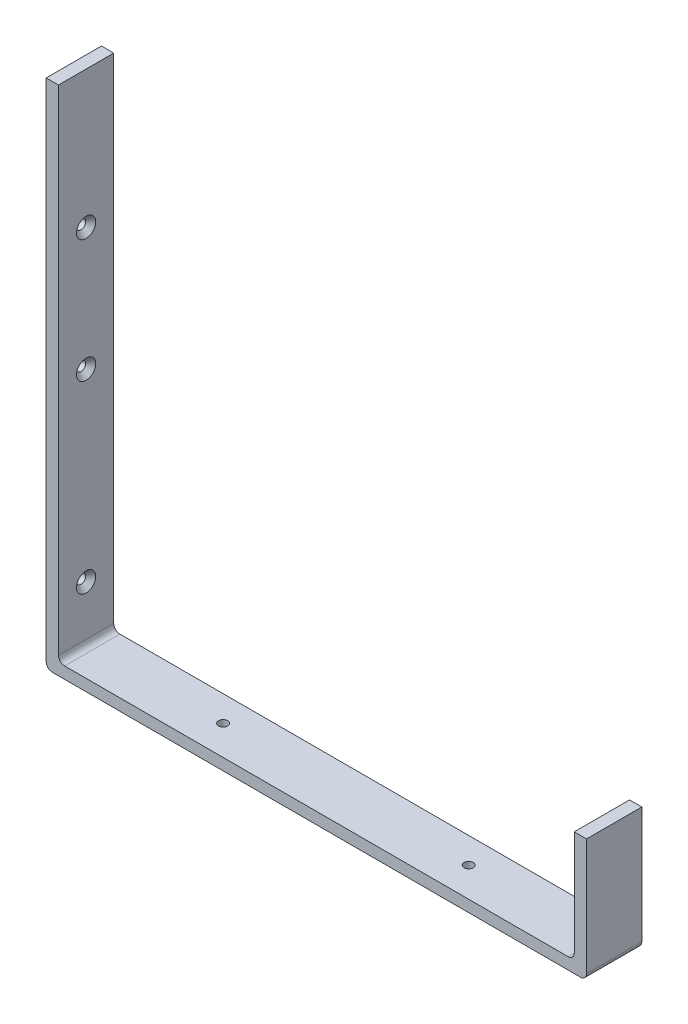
ISO-10303-21;
HEADER;
FILE_DESCRIPTION(('STEP AP214'),'2;1');
FILE_NAME('part.step','',(''),(''),'','','');
FILE_SCHEMA(('AUTOMOTIVE_DESIGN { 1 0 10303 214 1 1 1 1 }'));
ENDSEC;
DATA;
#1=APPLICATION_CONTEXT('core data for automotive mechanical design processes');
#2=APPLICATION_PROTOCOL_DEFINITION('international standard','automotive_design',2000,#1);
#3=PRODUCT_CONTEXT('',#1,'mechanical');
#4=PRODUCT('Part','Part','',(#3));
#5=PRODUCT_RELATED_PRODUCT_CATEGORY('part','',(#4));
#6=PRODUCT_DEFINITION_FORMATION('','',#4);
#7=PRODUCT_DEFINITION_CONTEXT('part definition',#1,'design');
#8=PRODUCT_DEFINITION('design','',#6,#7);
#9=PRODUCT_DEFINITION_SHAPE('','',#8);
#10=(LENGTH_UNIT() NAMED_UNIT(*) SI_UNIT(.MILLI.,.METRE.));
#11=(NAMED_UNIT(*) PLANE_ANGLE_UNIT() SI_UNIT($,.RADIAN.));
#12=(NAMED_UNIT(*) SI_UNIT($,.STERADIAN.) SOLID_ANGLE_UNIT());
#13=UNCERTAINTY_MEASURE_WITH_UNIT(LENGTH_MEASURE(1.E-05),#10,'distance_accuracy_value','');
#14=(GEOMETRIC_REPRESENTATION_CONTEXT(3) GLOBAL_UNCERTAINTY_ASSIGNED_CONTEXT((#13)) GLOBAL_UNIT_ASSIGNED_CONTEXT((#10,
#11,#12)) REPRESENTATION_CONTEXT('',''));
#15=CARTESIAN_POINT('',(0.,0.,0.));
#16=DIRECTION('',(0.,0.,1.));
#17=DIRECTION('',(1.,0.,0.));
#18=AXIS2_PLACEMENT_3D('',#15,#16,#17);
#19=CARTESIAN_POINT('',(-132.,125.,27.));
#20=DIRECTION('',(0.,-1.,0.));
#21=DIRECTION('',(0.,0.,-1.));
#22=AXIS2_PLACEMENT_3D('',#19,#20,#21);
#23=PLANE('',#22);
#24=DIRECTION('',(-1.,0.,0.));
#25=VECTOR('',#24,1.);
#26=CARTESIAN_POINT('',(-132.,125.,0.));
#27=LINE('',#26,#25);
#28=CARTESIAN_POINT('',(-126.,125.,0.));
#29=VERTEX_POINT('',#28);
#30=CARTESIAN_POINT('',(-132.,125.,0.));
#31=VERTEX_POINT('',#30);
#32=EDGE_CURVE('E147',#29,#31,#27,.T.);
#33=ORIENTED_EDGE('',*,*,#32,.T.);
#34=DIRECTION('',(0.,0.,-1.));
#35=VECTOR('',#34,1.);
#36=CARTESIAN_POINT('',(-132.,125.,27.));
#37=LINE('',#36,#35);
#38=CARTESIAN_POINT('',(-132.,125.,27.));
#39=VERTEX_POINT('',#38);
#40=EDGE_CURVE('E130',#39,#31,#37,.T.);
#41=ORIENTED_EDGE('',*,*,#40,.F.);
#42=DIRECTION('',(-1.,0.,0.));
#43=VECTOR('',#42,1.);
#44=CARTESIAN_POINT('',(-132.,125.,27.));
#45=LINE('',#44,#43);
#46=CARTESIAN_POINT('',(-126.,125.,27.));
#47=VERTEX_POINT('',#46);
#48=EDGE_CURVE('E136',#47,#39,#45,.T.);
#49=ORIENTED_EDGE('',*,*,#48,.F.);
#50=DIRECTION('',(0.,0.,-1.));
#51=VECTOR('',#50,1.);
#52=CARTESIAN_POINT('',(-126.,125.,27.));
#53=LINE('',#52,#51);
#54=EDGE_CURVE('E212',#47,#29,#53,.T.);
#55=ORIENTED_EDGE('',*,*,#54,.T.);
#56=EDGE_LOOP('',(#33,#41,#49,#55));
#57=FACE_BOUND('',#56,.T.);
#58=ADVANCED_FACE('F35',(#57),#23,.F.);
#59=CARTESIAN_POINT('',(-132.,-125.,27.));
#60=DIRECTION('',(1.,0.,0.));
#61=DIRECTION('',(0.,0.,-1.));
#62=AXIS2_PLACEMENT_3D('',#59,#60,#61);
#63=PLANE('',#62);
#64=CARTESIAN_POINT('',(-132.,-92.,13.5));
#65=DIRECTION('',(1.,0.,0.));
#66=DIRECTION('',(0.,0.,-1.));
#67=AXIS2_PLACEMENT_3D('',#64,#65,#66);
#68=CIRCLE('',#67,2.25);
#69=CARTESIAN_POINT('',(-132.,-92.,11.25));
#70=VERTEX_POINT('',#69);
#71=EDGE_CURVE('E351',#70,#70,#68,.T.);
#72=ORIENTED_EDGE('',*,*,#71,.T.);
#73=EDGE_LOOP('',(#72));
#74=FACE_BOUND('',#73,.T.);
#75=CARTESIAN_POINT('',(-132.,58.,13.5));
#76=DIRECTION('',(1.,0.,0.));
#77=DIRECTION('',(0.,0.,-1.));
#78=AXIS2_PLACEMENT_3D('',#75,#76,#77);
#79=CIRCLE('',#78,2.25);
#80=CARTESIAN_POINT('',(-132.,58.,11.25));
#81=VERTEX_POINT('',#80);
#82=EDGE_CURVE('E342',#81,#81,#79,.T.);
#83=ORIENTED_EDGE('',*,*,#82,.T.);
#84=EDGE_LOOP('',(#83));
#85=FACE_BOUND('',#84,.T.);
#86=CARTESIAN_POINT('',(-132.,-2.00000000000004,13.5));
#87=DIRECTION('',(1.,0.,0.));
#88=DIRECTION('',(0.,0.,-1.));
#89=AXIS2_PLACEMENT_3D('',#86,#87,#88);
#90=CIRCLE('',#89,2.25);
#91=CARTESIAN_POINT('',(-132.,-2.00000000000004,11.25));
#92=VERTEX_POINT('',#91);
#93=EDGE_CURVE('E331',#92,#92,#90,.T.);
#94=ORIENTED_EDGE('',*,*,#93,.T.);
#95=EDGE_LOOP('',(#94));
#96=FACE_BOUND('',#95,.T.);
#97=DIRECTION('',(0.,-1.,0.));
#98=VECTOR('',#97,1.);
#99=CARTESIAN_POINT('',(-132.,-125.,0.));
#100=LINE('',#99,#98);
#101=CARTESIAN_POINT('',(-132.,-122.,0.));
#102=VERTEX_POINT('',#101);
#103=EDGE_CURVE('E190',#31,#102,#100,.T.);
#104=ORIENTED_EDGE('',*,*,#103,.T.);
#105=DIRECTION('',(0.,0.,-1.));
#106=VECTOR('',#105,1.);
#107=CARTESIAN_POINT('',(-132.,-122.,27.));
#108=LINE('',#107,#106);
#109=CARTESIAN_POINT('',(-132.,-122.,27.));
#110=VERTEX_POINT('',#109);
#111=EDGE_CURVE('E133',#102,#110,#108,.F.);
#112=ORIENTED_EDGE('',*,*,#111,.T.);
#113=DIRECTION('',(0.,-1.,0.));
#114=VECTOR('',#113,1.);
#115=CARTESIAN_POINT('',(-132.,-125.,27.));
#116=LINE('',#115,#114);
#117=EDGE_CURVE('E125',#39,#110,#116,.T.);
#118=ORIENTED_EDGE('',*,*,#117,.F.);
#119=ORIENTED_EDGE('',*,*,#40,.T.);
#120=EDGE_LOOP('',(#104,#112,#118,#119));
#121=FACE_BOUND('',#120,.T.);
#122=ADVANCED_FACE('F128',(#74,#85,#96,#121),#63,.F.);
#123=CARTESIAN_POINT('',(132.,-125.,27.));
#124=DIRECTION('',(0.,1.,0.));
#125=DIRECTION('',(-1.,0.,0.));
#126=AXIS2_PLACEMENT_3D('',#123,#124,#125);
#127=PLANE('',#126);
#128=CARTESIAN_POINT('',(-60.,-125.,12.5721452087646));
#129=DIRECTION('',(0.,-1.,0.));
#130=DIRECTION('',(0.,0.,-1.));
#131=AXIS2_PLACEMENT_3D('',#128,#129,#130);
#132=CIRCLE('',#131,4.7);
#133=CARTESIAN_POINT('',(-60.,-125.,7.8721452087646));
#134=VERTEX_POINT('',#133);
#135=EDGE_CURVE('E327',#134,#134,#132,.T.);
#136=ORIENTED_EDGE('',*,*,#135,.F.);
#137=EDGE_LOOP('',(#136));
#138=FACE_BOUND('',#137,.T.);
#139=CARTESIAN_POINT('',(60.,-125.,12.5721452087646));
#140=DIRECTION('',(0.,-1.,0.));
#141=DIRECTION('',(0.,0.,-1.));
#142=AXIS2_PLACEMENT_3D('',#139,#140,#141);
#143=CIRCLE('',#142,4.7);
#144=CARTESIAN_POINT('',(60.,-125.,7.8721452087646));
#145=VERTEX_POINT('',#144);
#146=EDGE_CURVE('E193',#145,#145,#143,.T.);
#147=ORIENTED_EDGE('',*,*,#146,.F.);
#148=EDGE_LOOP('',(#147));
#149=FACE_BOUND('',#148,.T.);
#150=DIRECTION('',(1.,0.,0.));
#151=VECTOR('',#150,1.);
#152=CARTESIAN_POINT('',(132.,-125.,27.));
#153=LINE('',#152,#151);
#154=CARTESIAN_POINT('',(-129.,-125.,27.));
#155=VERTEX_POINT('',#154);
#156=CARTESIAN_POINT('',(129.,-125.,27.));
#157=VERTEX_POINT('',#156);
#158=EDGE_CURVE('E135',#155,#157,#153,.T.);
#159=ORIENTED_EDGE('',*,*,#158,.F.);
#160=DIRECTION('',(0.,0.,-1.));
#161=VECTOR('',#160,1.);
#162=CARTESIAN_POINT('',(-129.,-125.,27.));
#163=LINE('',#162,#161);
#164=CARTESIAN_POINT('',(-129.,-125.,0.));
#165=VERTEX_POINT('',#164);
#166=EDGE_CURVE('E151',#155,#165,#163,.T.);
#167=ORIENTED_EDGE('',*,*,#166,.T.);
#168=DIRECTION('',(1.,0.,0.));
#169=VECTOR('',#168,1.);
#170=CARTESIAN_POINT('',(132.,-125.,0.));
#171=LINE('',#170,#169);
#172=CARTESIAN_POINT('',(129.,-125.,0.));
#173=VERTEX_POINT('',#172);
#174=EDGE_CURVE('E215',#165,#173,#171,.T.);
#175=ORIENTED_EDGE('',*,*,#174,.T.);
#176=DIRECTION('',(0.,0.,-1.));
#177=VECTOR('',#176,1.);
#178=CARTESIAN_POINT('',(129.,-125.,27.));
#179=LINE('',#178,#177);
#180=EDGE_CURVE('E148',#173,#157,#179,.F.);
#181=ORIENTED_EDGE('',*,*,#180,.T.);
#182=EDGE_LOOP('',(#159,#167,#175,#181));
#183=FACE_BOUND('',#182,.T.);
#184=ADVANCED_FACE('F260',(#138,#149,#183),#127,.F.);
#185=CARTESIAN_POINT('',(132.,-125.,27.));
#186=DIRECTION('',(-1.,0.,0.));
#187=DIRECTION('',(0.,0.,1.));
#188=AXIS2_PLACEMENT_3D('',#185,#186,#187);
#189=PLANE('',#188);
#190=DIRECTION('',(0.,1.,0.));
#191=VECTOR('',#190,1.);
#192=CARTESIAN_POINT('',(132.,-125.,27.));
#193=LINE('',#192,#191);
#194=CARTESIAN_POINT('',(132.,-122.,27.));
#195=VERTEX_POINT('',#194);
#196=CARTESIAN_POINT('',(132.,-65.,27.));
#197=VERTEX_POINT('',#196);
#198=EDGE_CURVE('E203',#195,#197,#193,.T.);
#199=ORIENTED_EDGE('',*,*,#198,.F.);
#200=DIRECTION('',(0.,0.,-1.));
#201=VECTOR('',#200,1.);
#202=CARTESIAN_POINT('',(132.,-122.,27.));
#203=LINE('',#202,#201);
#204=CARTESIAN_POINT('',(132.,-122.,0.));
#205=VERTEX_POINT('',#204);
#206=EDGE_CURVE('E169',#195,#205,#203,.T.);
#207=ORIENTED_EDGE('',*,*,#206,.T.);
#208=DIRECTION('',(0.,1.,0.));
#209=VECTOR('',#208,1.);
#210=CARTESIAN_POINT('',(132.,-125.,0.));
#211=LINE('',#210,#209);
#212=CARTESIAN_POINT('',(132.,-65.,0.));
#213=VERTEX_POINT('',#212);
#214=EDGE_CURVE('E218',#205,#213,#211,.T.);
#215=ORIENTED_EDGE('',*,*,#214,.T.);
#216=DIRECTION('',(0.,0.,-1.));
#217=VECTOR('',#216,1.);
#218=CARTESIAN_POINT('',(132.,-65.,27.));
#219=LINE('',#218,#217);
#220=EDGE_CURVE('E149',#197,#213,#219,.T.);
#221=ORIENTED_EDGE('',*,*,#220,.F.);
#222=EDGE_LOOP('',(#199,#207,#215,#221));
#223=FACE_BOUND('',#222,.T.);
#224=ADVANCED_FACE('F268',(#223),#189,.F.);
#225=CARTESIAN_POINT('',(126.,-65.,27.));
#226=DIRECTION('',(0.,-1.,0.));
#227=DIRECTION('',(0.,0.,-1.));
#228=AXIS2_PLACEMENT_3D('',#225,#226,#227);
#229=PLANE('',#228);
#230=DIRECTION('',(-1.,0.,0.));
#231=VECTOR('',#230,1.);
#232=CARTESIAN_POINT('',(126.,-65.,0.));
#233=LINE('',#232,#231);
#234=CARTESIAN_POINT('',(126.,-65.,0.));
#235=VERTEX_POINT('',#234);
#236=EDGE_CURVE('E220',#213,#235,#233,.T.);
#237=ORIENTED_EDGE('',*,*,#236,.T.);
#238=DIRECTION('',(0.,0.,-1.));
#239=VECTOR('',#238,1.);
#240=CARTESIAN_POINT('',(126.,-65.,27.));
#241=LINE('',#240,#239);
#242=CARTESIAN_POINT('',(126.,-65.,27.));
#243=VERTEX_POINT('',#242);
#244=EDGE_CURVE('E154',#243,#235,#241,.T.);
#245=ORIENTED_EDGE('',*,*,#244,.F.);
#246=DIRECTION('',(-1.,0.,0.));
#247=VECTOR('',#246,1.);
#248=CARTESIAN_POINT('',(126.,-65.,27.));
#249=LINE('',#248,#247);
#250=EDGE_CURVE('E205',#197,#243,#249,.T.);
#251=ORIENTED_EDGE('',*,*,#250,.F.);
#252=ORIENTED_EDGE('',*,*,#220,.T.);
#253=EDGE_LOOP('',(#237,#245,#251,#252));
#254=FACE_BOUND('',#253,.T.);
#255=ADVANCED_FACE('F269',(#254),#229,.F.);
#256=CARTESIAN_POINT('',(126.,-119.318181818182,27.));
#257=DIRECTION('',(1.,0.,0.));
#258=DIRECTION('',(0.,0.,-1.));
#259=AXIS2_PLACEMENT_3D('',#256,#257,#258);
#260=PLANE('',#259);
#261=DIRECTION('',(0.,-1.,0.));
#262=VECTOR('',#261,1.);
#263=CARTESIAN_POINT('',(126.,-119.318181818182,0.));
#264=LINE('',#263,#262);
#265=CARTESIAN_POINT('',(126.,-116.318181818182,0.));
#266=VERTEX_POINT('',#265);
#267=EDGE_CURVE('E222',#235,#266,#264,.T.);
#268=ORIENTED_EDGE('',*,*,#267,.T.);
#269=DIRECTION('',(0.,0.,-1.));
#270=VECTOR('',#269,1.);
#271=CARTESIAN_POINT('',(126.,-116.318181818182,27.));
#272=LINE('',#271,#270);
#273=CARTESIAN_POINT('',(126.,-116.318181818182,27.));
#274=VERTEX_POINT('',#273);
#275=EDGE_CURVE('E177',#266,#274,#272,.F.);
#276=ORIENTED_EDGE('',*,*,#275,.T.);
#277=DIRECTION('',(0.,-1.,0.));
#278=VECTOR('',#277,1.);
#279=CARTESIAN_POINT('',(126.,-119.318181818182,27.));
#280=LINE('',#279,#278);
#281=EDGE_CURVE('E207',#243,#274,#280,.T.);
#282=ORIENTED_EDGE('',*,*,#281,.F.);
#283=ORIENTED_EDGE('',*,*,#244,.T.);
#284=EDGE_LOOP('',(#268,#276,#282,#283));
#285=FACE_BOUND('',#284,.T.);
#286=ADVANCED_FACE('F234',(#285),#260,.F.);
#287=CARTESIAN_POINT('',(-126.,-119.318181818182,27.));
#288=DIRECTION('',(0.,-1.,0.));
#289=DIRECTION('',(0.,0.,-1.));
#290=AXIS2_PLACEMENT_3D('',#287,#288,#289);
#291=PLANE('',#290);
#292=CARTESIAN_POINT('',(-60.,-119.318181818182,12.5721452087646));
#293=DIRECTION('',(0.,-1.,0.));
#294=DIRECTION('',(0.,0.,-1.));
#295=AXIS2_PLACEMENT_3D('',#292,#293,#294);
#296=CIRCLE('',#295,2.24999999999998);
#297=CARTESIAN_POINT('',(-60.,-119.318181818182,10.3221452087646));
#298=VERTEX_POINT('',#297);
#299=EDGE_CURVE('E39',#298,#298,#296,.T.);
#300=ORIENTED_EDGE('',*,*,#299,.T.);
#301=EDGE_LOOP('',(#300));
#302=FACE_BOUND('',#301,.T.);
#303=CARTESIAN_POINT('',(60.,-119.318181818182,12.5721452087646));
#304=DIRECTION('',(0.,-1.,0.));
#305=DIRECTION('',(0.,0.,-1.));
#306=AXIS2_PLACEMENT_3D('',#303,#304,#305);
#307=CIRCLE('',#306,2.24999999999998);
#308=CARTESIAN_POINT('',(60.,-119.318181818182,10.3221452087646));
#309=VERTEX_POINT('',#308);
#310=EDGE_CURVE('E185',#309,#309,#307,.T.);
#311=ORIENTED_EDGE('',*,*,#310,.T.);
#312=EDGE_LOOP('',(#311));
#313=FACE_BOUND('',#312,.T.);
#314=DIRECTION('',(-1.,0.,0.));
#315=VECTOR('',#314,1.);
#316=CARTESIAN_POINT('',(-126.,-119.318181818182,27.));
#317=LINE('',#316,#315);
#318=CARTESIAN_POINT('',(123.,-119.318181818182,27.));
#319=VERTEX_POINT('',#318);
#320=CARTESIAN_POINT('',(-123.,-119.318181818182,27.));
#321=VERTEX_POINT('',#320);
#322=EDGE_CURVE('E210',#319,#321,#317,.T.);
#323=ORIENTED_EDGE('',*,*,#322,.F.);
#324=DIRECTION('',(0.,0.,-1.));
#325=VECTOR('',#324,1.);
#326=CARTESIAN_POINT('',(123.,-119.318181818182,0.));
#327=LINE('',#326,#325);
#328=CARTESIAN_POINT('',(123.,-119.318181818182,0.));
#329=VERTEX_POINT('',#328);
#330=EDGE_CURVE('E174',#319,#329,#327,.T.);
#331=ORIENTED_EDGE('',*,*,#330,.T.);
#332=DIRECTION('',(-1.,0.,0.));
#333=VECTOR('',#332,1.);
#334=CARTESIAN_POINT('',(-126.,-119.318181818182,0.));
#335=LINE('',#334,#333);
#336=CARTESIAN_POINT('',(-123.,-119.318181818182,0.));
#337=VERTEX_POINT('',#336);
#338=EDGE_CURVE('E225',#329,#337,#335,.T.);
#339=ORIENTED_EDGE('',*,*,#338,.T.);
#340=DIRECTION('',(0.,0.,-1.));
#341=VECTOR('',#340,1.);
#342=CARTESIAN_POINT('',(-123.,-119.318181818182,27.));
#343=LINE('',#342,#341);
#344=EDGE_CURVE('E172',#337,#321,#343,.F.);
#345=ORIENTED_EDGE('',*,*,#344,.T.);
#346=EDGE_LOOP('',(#323,#331,#339,#345));
#347=FACE_BOUND('',#346,.T.);
#348=ADVANCED_FACE('F250',(#302,#313,#347),#291,.F.);
#349=CARTESIAN_POINT('',(-126.,125.,27.));
#350=DIRECTION('',(-1.,0.,0.));
#351=DIRECTION('',(0.,-1.,0.));
#352=AXIS2_PLACEMENT_3D('',#349,#350,#351);
#353=PLANE('',#352);
#354=CARTESIAN_POINT('',(-126.,-92.,13.5));
#355=DIRECTION('',(1.,0.,0.));
#356=DIRECTION('',(0.,0.,-1.));
#357=AXIS2_PLACEMENT_3D('',#354,#355,#356);
#358=CIRCLE('',#357,4.7);
#359=CARTESIAN_POINT('',(-126.,-92.,8.8));
#360=VERTEX_POINT('',#359);
#361=EDGE_CURVE('E357',#360,#360,#358,.T.);
#362=ORIENTED_EDGE('',*,*,#361,.F.);
#363=EDGE_LOOP('',(#362));
#364=FACE_BOUND('',#363,.T.);
#365=CARTESIAN_POINT('',(-126.,58.,13.5));
#366=DIRECTION('',(1.,0.,0.));
#367=DIRECTION('',(0.,0.,-1.));
#368=AXIS2_PLACEMENT_3D('',#365,#366,#367);
#369=CIRCLE('',#368,4.7);
#370=CARTESIAN_POINT('',(-126.,58.,8.8));
#371=VERTEX_POINT('',#370);
#372=EDGE_CURVE('E348',#371,#371,#369,.T.);
#373=ORIENTED_EDGE('',*,*,#372,.F.);
#374=EDGE_LOOP('',(#373));
#375=FACE_BOUND('',#374,.T.);
#376=CARTESIAN_POINT('',(-126.,-2.00000000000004,13.5));
#377=DIRECTION('',(1.,0.,0.));
#378=DIRECTION('',(0.,0.,-1.));
#379=AXIS2_PLACEMENT_3D('',#376,#377,#378);
#380=CIRCLE('',#379,4.7);
#381=CARTESIAN_POINT('',(-126.,-2.00000000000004,8.8));
#382=VERTEX_POINT('',#381);
#383=EDGE_CURVE('E339',#382,#382,#380,.T.);
#384=ORIENTED_EDGE('',*,*,#383,.F.);
#385=EDGE_LOOP('',(#384));
#386=FACE_BOUND('',#385,.T.);
#387=DIRECTION('',(0.,1.,0.));
#388=VECTOR('',#387,1.);
#389=CARTESIAN_POINT('',(-126.,125.,27.));
#390=LINE('',#389,#388);
#391=CARTESIAN_POINT('',(-126.,-116.318181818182,27.));
#392=VERTEX_POINT('',#391);
#393=EDGE_CURVE('E140',#392,#47,#390,.T.);
#394=ORIENTED_EDGE('',*,*,#393,.F.);
#395=DIRECTION('',(0.,0.,-1.));
#396=VECTOR('',#395,1.);
#397=CARTESIAN_POINT('',(-126.,-116.318181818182,0.));
#398=LINE('',#397,#396);
#399=CARTESIAN_POINT('',(-126.,-116.318181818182,0.));
#400=VERTEX_POINT('',#399);
#401=EDGE_CURVE('E179',#392,#400,#398,.T.);
#402=ORIENTED_EDGE('',*,*,#401,.T.);
#403=DIRECTION('',(0.,1.,0.));
#404=VECTOR('',#403,1.);
#405=CARTESIAN_POINT('',(-126.,125.,0.));
#406=LINE('',#405,#404);
#407=EDGE_CURVE('E144',#400,#29,#406,.T.);
#408=ORIENTED_EDGE('',*,*,#407,.T.);
#409=ORIENTED_EDGE('',*,*,#54,.F.);
#410=EDGE_LOOP('',(#394,#402,#408,#409));
#411=FACE_BOUND('',#410,.T.);
#412=ADVANCED_FACE('F253',(#364,#375,#386,#411),#353,.F.);
#413=CARTESIAN_POINT('',(0.,0.,27.));
#414=DIRECTION('',(0.,0.,-1.));
#415=DIRECTION('',(-1.,0.,0.));
#416=AXIS2_PLACEMENT_3D('',#413,#414,#415);
#417=PLANE('',#416);
#418=ORIENTED_EDGE('',*,*,#117,.T.);
#419=CARTESIAN_POINT('',(-129.,-122.,27.));
#420=DIRECTION('',(0.,0.,-1.));
#421=DIRECTION('',(-1.,0.,0.));
#422=AXIS2_PLACEMENT_3D('',#419,#420,#421);
#423=CIRCLE('',#422,3.);
#424=EDGE_CURVE('E167',#110,#155,#423,.F.);
#425=ORIENTED_EDGE('',*,*,#424,.T.);
#426=ORIENTED_EDGE('',*,*,#158,.T.);
#427=CARTESIAN_POINT('',(129.,-122.,27.));
#428=DIRECTION('',(0.,0.,-1.));
#429=DIRECTION('',(-1.,0.,0.));
#430=AXIS2_PLACEMENT_3D('',#427,#428,#429);
#431=CIRCLE('',#430,3.);
#432=EDGE_CURVE('E165',#157,#195,#431,.F.);
#433=ORIENTED_EDGE('',*,*,#432,.T.);
#434=ORIENTED_EDGE('',*,*,#198,.T.);
#435=ORIENTED_EDGE('',*,*,#250,.T.);
#436=ORIENTED_EDGE('',*,*,#281,.T.);
#437=CARTESIAN_POINT('',(123.,-116.318181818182,27.));
#438=DIRECTION('',(0.,0.,-1.));
#439=DIRECTION('',(-1.,0.,0.));
#440=AXIS2_PLACEMENT_3D('',#437,#438,#439);
#441=CIRCLE('',#440,3.);
#442=EDGE_CURVE('E183',#274,#319,#441,.T.);
#443=ORIENTED_EDGE('',*,*,#442,.T.);
#444=ORIENTED_EDGE('',*,*,#322,.T.);
#445=CARTESIAN_POINT('',(-123.,-116.318181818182,27.));
#446=DIRECTION('',(0.,0.,-1.));
#447=DIRECTION('',(-1.,0.,0.));
#448=AXIS2_PLACEMENT_3D('',#445,#446,#447);
#449=CIRCLE('',#448,3.);
#450=EDGE_CURVE('E11',#321,#392,#449,.T.);
#451=ORIENTED_EDGE('',*,*,#450,.T.);
#452=ORIENTED_EDGE('',*,*,#393,.T.);
#453=ORIENTED_EDGE('',*,*,#48,.T.);
#454=EDGE_LOOP('',(#418,#425,#426,#433,#434,#435,#436,#443,#444,#451,#452,#453));
#455=FACE_BOUND('',#454,.T.);
#456=ADVANCED_FACE('F139',(#455),#417,.F.);
#457=CARTESIAN_POINT('',(0.,0.,0.));
#458=DIRECTION('',(0.,0.,-1.));
#459=DIRECTION('',(-1.,0.,0.));
#460=AXIS2_PLACEMENT_3D('',#457,#458,#459);
#461=PLANE('',#460);
#462=ORIENTED_EDGE('',*,*,#174,.F.);
#463=CARTESIAN_POINT('',(-129.,-122.,0.));
#464=DIRECTION('',(0.,0.,-1.));
#465=DIRECTION('',(-1.,0.,0.));
#466=AXIS2_PLACEMENT_3D('',#463,#464,#465);
#467=CIRCLE('',#466,3.);
#468=EDGE_CURVE('E162',#165,#102,#467,.T.);
#469=ORIENTED_EDGE('',*,*,#468,.T.);
#470=ORIENTED_EDGE('',*,*,#103,.F.);
#471=ORIENTED_EDGE('',*,*,#32,.F.);
#472=ORIENTED_EDGE('',*,*,#407,.F.);
#473=CARTESIAN_POINT('',(-123.,-116.318181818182,0.));
#474=DIRECTION('',(0.,0.,-1.));
#475=DIRECTION('',(-1.,0.,0.));
#476=AXIS2_PLACEMENT_3D('',#473,#474,#475);
#477=CIRCLE('',#476,3.);
#478=EDGE_CURVE('E44',#400,#337,#477,.F.);
#479=ORIENTED_EDGE('',*,*,#478,.T.);
#480=ORIENTED_EDGE('',*,*,#338,.F.);
#481=CARTESIAN_POINT('',(123.,-116.318181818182,0.));
#482=DIRECTION('',(0.,0.,-1.));
#483=DIRECTION('',(-1.,0.,0.));
#484=AXIS2_PLACEMENT_3D('',#481,#482,#483);
#485=CIRCLE('',#484,3.);
#486=EDGE_CURVE('E181',#329,#266,#485,.F.);
#487=ORIENTED_EDGE('',*,*,#486,.T.);
#488=ORIENTED_EDGE('',*,*,#267,.F.);
#489=ORIENTED_EDGE('',*,*,#236,.F.);
#490=ORIENTED_EDGE('',*,*,#214,.F.);
#491=CARTESIAN_POINT('',(129.,-122.,0.));
#492=DIRECTION('',(0.,0.,-1.));
#493=DIRECTION('',(-1.,0.,0.));
#494=AXIS2_PLACEMENT_3D('',#491,#492,#493);
#495=CIRCLE('',#494,3.);
#496=EDGE_CURVE('E160',#205,#173,#495,.T.);
#497=ORIENTED_EDGE('',*,*,#496,.T.);
#498=EDGE_LOOP('',(#462,#469,#470,#471,#472,#479,#480,#487,#488,#489,#490,#497));
#499=FACE_BOUND('',#498,.T.);
#500=ADVANCED_FACE('F241',(#499),#461,.T.);
#501=CARTESIAN_POINT('',(-129.,-122.,27.));
#502=DIRECTION('',(0.,0.,-1.));
#503=DIRECTION('',(-1.,0.,0.));
#504=AXIS2_PLACEMENT_3D('',#501,#502,#503);
#505=CYLINDRICAL_SURFACE('',#504,3.);
#506=ORIENTED_EDGE('',*,*,#424,.F.);
#507=ORIENTED_EDGE('',*,*,#111,.F.);
#508=ORIENTED_EDGE('',*,*,#468,.F.);
#509=ORIENTED_EDGE('',*,*,#166,.F.);
#510=EDGE_LOOP('',(#506,#507,#508,#509));
#511=FACE_BOUND('',#510,.T.);
#512=ADVANCED_FACE('F255',(#511),#505,.T.);
#513=CARTESIAN_POINT('',(129.,-122.,27.));
#514=DIRECTION('',(0.,0.,-1.));
#515=DIRECTION('',(-1.,0.,0.));
#516=AXIS2_PLACEMENT_3D('',#513,#514,#515);
#517=CYLINDRICAL_SURFACE('',#516,3.);
#518=ORIENTED_EDGE('',*,*,#432,.F.);
#519=ORIENTED_EDGE('',*,*,#180,.F.);
#520=ORIENTED_EDGE('',*,*,#496,.F.);
#521=ORIENTED_EDGE('',*,*,#206,.F.);
#522=EDGE_LOOP('',(#518,#519,#520,#521));
#523=FACE_BOUND('',#522,.T.);
#524=ADVANCED_FACE('F263',(#523),#517,.T.);
#525=CARTESIAN_POINT('',(123.,-116.318181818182,27.));
#526=DIRECTION('',(0.,0.,1.));
#527=DIRECTION('',(1.,0.,0.));
#528=AXIS2_PLACEMENT_3D('',#525,#526,#527);
#529=CYLINDRICAL_SURFACE('',#528,3.);
#530=ORIENTED_EDGE('',*,*,#442,.F.);
#531=ORIENTED_EDGE('',*,*,#275,.F.);
#532=ORIENTED_EDGE('',*,*,#486,.F.);
#533=ORIENTED_EDGE('',*,*,#330,.F.);
#534=EDGE_LOOP('',(#530,#531,#532,#533));
#535=FACE_BOUND('',#534,.T.);
#536=ADVANCED_FACE('F247',(#535),#529,.F.);
#537=CARTESIAN_POINT('',(-123.,-116.318181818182,27.));
#538=DIRECTION('',(0.,0.,1.));
#539=DIRECTION('',(1.,0.,0.));
#540=AXIS2_PLACEMENT_3D('',#537,#538,#539);
#541=CYLINDRICAL_SURFACE('',#540,3.);
#542=ORIENTED_EDGE('',*,*,#450,.F.);
#543=ORIENTED_EDGE('',*,*,#344,.F.);
#544=ORIENTED_EDGE('',*,*,#478,.F.);
#545=ORIENTED_EDGE('',*,*,#401,.F.);
#546=EDGE_LOOP('',(#542,#543,#544,#545));
#547=FACE_BOUND('',#546,.T.);
#548=ADVANCED_FACE('F37',(#547),#541,.F.);
#549=CARTESIAN_POINT('',(60.,-125.,12.5721452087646));
#550=DIRECTION('',(0.,-1.,0.));
#551=DIRECTION('',(0.,0.,-1.));
#552=AXIS2_PLACEMENT_3D('',#549,#550,#551);
#553=CYLINDRICAL_SURFACE('',#552,2.24999999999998);
#554=CARTESIAN_POINT('',(60.,-122.55,12.5721452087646));
#555=DIRECTION('',(0.,-1.,0.));
#556=DIRECTION('',(0.,0.,-1.));
#557=AXIS2_PLACEMENT_3D('',#554,#555,#556);
#558=CIRCLE('',#557,2.25);
#559=CARTESIAN_POINT('',(60.,-122.55,10.3221452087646));
#560=VERTEX_POINT('',#559);
#561=EDGE_CURVE('E187',#560,#560,#558,.T.);
#562=ORIENTED_EDGE('',*,*,#561,.T.);
#563=EDGE_LOOP('',(#562));
#564=FACE_BOUND('',#563,.T.);
#565=ORIENTED_EDGE('',*,*,#310,.F.);
#566=EDGE_LOOP('',(#565));
#567=FACE_BOUND('',#566,.T.);
#568=ADVANCED_FACE('F295',(#564,#567),#553,.F.);
#569=CARTESIAN_POINT('',(60.,-125.,12.5721452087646));
#570=DIRECTION('',(0.,-1.,0.));
#571=DIRECTION('',(0.,0.,-1.));
#572=AXIS2_PLACEMENT_3D('',#569,#570,#571);
#573=CONICAL_SURFACE('',#572,4.7,0.785398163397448);
#574=ORIENTED_EDGE('',*,*,#561,.F.);
#575=EDGE_LOOP('',(#574));
#576=FACE_BOUND('',#575,.T.);
#577=ORIENTED_EDGE('',*,*,#146,.T.);
#578=EDGE_LOOP('',(#577));
#579=FACE_BOUND('',#578,.T.);
#580=ADVANCED_FACE('F299',(#576,#579),#573,.F.);
#581=CARTESIAN_POINT('',(-60.,-125.,12.5721452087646));
#582=DIRECTION('',(0.,-1.,0.));
#583=DIRECTION('',(0.,0.,-1.));
#584=AXIS2_PLACEMENT_3D('',#581,#582,#583);
#585=CYLINDRICAL_SURFACE('',#584,2.24999999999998);
#586=CARTESIAN_POINT('',(-60.,-122.55,12.5721452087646));
#587=DIRECTION('',(0.,-1.,0.));
#588=DIRECTION('',(0.,0.,-1.));
#589=AXIS2_PLACEMENT_3D('',#586,#587,#588);
#590=CIRCLE('',#589,2.25);
#591=CARTESIAN_POINT('',(-60.,-122.55,10.3221452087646));
#592=VERTEX_POINT('',#591);
#593=EDGE_CURVE('E325',#592,#592,#590,.T.);
#594=ORIENTED_EDGE('',*,*,#593,.T.);
#595=EDGE_LOOP('',(#594));
#596=FACE_BOUND('',#595,.T.);
#597=ORIENTED_EDGE('',*,*,#299,.F.);
#598=EDGE_LOOP('',(#597));
#599=FACE_BOUND('',#598,.T.);
#600=ADVANCED_FACE('F304',(#596,#599),#585,.F.);
#601=CARTESIAN_POINT('',(-60.,-125.,12.5721452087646));
#602=DIRECTION('',(0.,-1.,0.));
#603=DIRECTION('',(0.,0.,-1.));
#604=AXIS2_PLACEMENT_3D('',#601,#602,#603);
#605=CONICAL_SURFACE('',#604,4.7,0.785398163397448);
#606=ORIENTED_EDGE('',*,*,#593,.F.);
#607=EDGE_LOOP('',(#606));
#608=FACE_BOUND('',#607,.T.);
#609=ORIENTED_EDGE('',*,*,#135,.T.);
#610=EDGE_LOOP('',(#609));
#611=FACE_BOUND('',#610,.T.);
#612=ADVANCED_FACE('F380',(#608,#611),#605,.F.);
#613=CARTESIAN_POINT('',(-126.,-2.00000000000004,13.5));
#614=DIRECTION('',(1.,0.,0.));
#615=DIRECTION('',(0.,0.,-1.));
#616=AXIS2_PLACEMENT_3D('',#613,#614,#615);
#617=CYLINDRICAL_SURFACE('',#616,2.24999999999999);
#618=ORIENTED_EDGE('',*,*,#93,.F.);
#619=EDGE_LOOP('',(#618));
#620=FACE_BOUND('',#619,.T.);
#621=CARTESIAN_POINT('',(-128.45,-2.00000000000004,13.5));
#622=DIRECTION('',(1.,0.,0.));
#623=DIRECTION('',(0.,0.,-1.));
#624=AXIS2_PLACEMENT_3D('',#621,#622,#623);
#625=CIRCLE('',#624,2.24999999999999);
#626=CARTESIAN_POINT('',(-128.45,-2.00000000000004,11.25));
#627=VERTEX_POINT('',#626);
#628=EDGE_CURVE('E336',#627,#627,#625,.T.);
#629=ORIENTED_EDGE('',*,*,#628,.T.);
#630=EDGE_LOOP('',(#629));
#631=FACE_BOUND('',#630,.T.);
#632=ADVANCED_FACE('F370',(#620,#631),#617,.F.);
#633=CARTESIAN_POINT('',(-126.,-2.00000000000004,13.5));
#634=DIRECTION('',(1.,0.,0.));
#635=DIRECTION('',(0.,0.,-1.));
#636=AXIS2_PLACEMENT_3D('',#633,#634,#635);
#637=CONICAL_SURFACE('',#636,4.7,0.785398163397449);
#638=ORIENTED_EDGE('',*,*,#628,.F.);
#639=EDGE_LOOP('',(#638));
#640=FACE_BOUND('',#639,.T.);
#641=ORIENTED_EDGE('',*,*,#383,.T.);
#642=EDGE_LOOP('',(#641));
#643=FACE_BOUND('',#642,.T.);
#644=ADVANCED_FACE('F367',(#640,#643),#637,.F.);
#645=CARTESIAN_POINT('',(-126.,58.,13.5));
#646=DIRECTION('',(1.,0.,0.));
#647=DIRECTION('',(0.,0.,-1.));
#648=AXIS2_PLACEMENT_3D('',#645,#646,#647);
#649=CYLINDRICAL_SURFACE('',#648,2.25);
#650=ORIENTED_EDGE('',*,*,#82,.F.);
#651=EDGE_LOOP('',(#650));
#652=FACE_BOUND('',#651,.T.);
#653=CARTESIAN_POINT('',(-128.45,58.,13.5));
#654=DIRECTION('',(1.,0.,0.));
#655=DIRECTION('',(0.,0.,-1.));
#656=AXIS2_PLACEMENT_3D('',#653,#654,#655);
#657=CIRCLE('',#656,2.24999999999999);
#658=CARTESIAN_POINT('',(-128.45,58.,11.25));
#659=VERTEX_POINT('',#658);
#660=EDGE_CURVE('E345',#659,#659,#657,.T.);
#661=ORIENTED_EDGE('',*,*,#660,.T.);
#662=EDGE_LOOP('',(#661));
#663=FACE_BOUND('',#662,.T.);
#664=ADVANCED_FACE('F369',(#652,#663),#649,.F.);
#665=CARTESIAN_POINT('',(-126.,58.,13.5));
#666=DIRECTION('',(1.,0.,0.));
#667=DIRECTION('',(0.,0.,-1.));
#668=AXIS2_PLACEMENT_3D('',#665,#666,#667);
#669=CONICAL_SURFACE('',#668,4.7,0.785398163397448);
#670=ORIENTED_EDGE('',*,*,#660,.F.);
#671=EDGE_LOOP('',(#670));
#672=FACE_BOUND('',#671,.T.);
#673=ORIENTED_EDGE('',*,*,#372,.T.);
#674=EDGE_LOOP('',(#673));
#675=FACE_BOUND('',#674,.T.);
#676=ADVANCED_FACE('F377',(#672,#675),#669,.F.);
#677=CARTESIAN_POINT('',(-126.,-92.,13.5));
#678=DIRECTION('',(1.,0.,0.));
#679=DIRECTION('',(0.,0.,-1.));
#680=AXIS2_PLACEMENT_3D('',#677,#678,#679);
#681=CYLINDRICAL_SURFACE('',#680,2.25);
#682=ORIENTED_EDGE('',*,*,#71,.F.);
#683=EDGE_LOOP('',(#682));
#684=FACE_BOUND('',#683,.T.);
#685=CARTESIAN_POINT('',(-128.45,-92.,13.5));
#686=DIRECTION('',(1.,0.,0.));
#687=DIRECTION('',(0.,0.,-1.));
#688=AXIS2_PLACEMENT_3D('',#685,#686,#687);
#689=CIRCLE('',#688,2.24999999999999);
#690=CARTESIAN_POINT('',(-128.45,-92.,11.25));
#691=VERTEX_POINT('',#690);
#692=EDGE_CURVE('E354',#691,#691,#689,.T.);
#693=ORIENTED_EDGE('',*,*,#692,.T.);
#694=EDGE_LOOP('',(#693));
#695=FACE_BOUND('',#694,.T.);
#696=ADVANCED_FACE('F422',(#684,#695),#681,.F.);
#697=CARTESIAN_POINT('',(-126.,-92.,13.5));
#698=DIRECTION('',(1.,0.,0.));
#699=DIRECTION('',(0.,0.,-1.));
#700=AXIS2_PLACEMENT_3D('',#697,#698,#699);
#701=CONICAL_SURFACE('',#700,4.7,0.785398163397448);
#702=ORIENTED_EDGE('',*,*,#692,.F.);
#703=EDGE_LOOP('',(#702));
#704=FACE_BOUND('',#703,.T.);
#705=ORIENTED_EDGE('',*,*,#361,.T.);
#706=EDGE_LOOP('',(#705));
#707=FACE_BOUND('',#706,.T.);
#708=ADVANCED_FACE('F361',(#704,#707),#701,.F.);
#709=CLOSED_SHELL('',(#58,#122,#184,#224,#255,#286,#348,#412,#456,#500,#512,#524,#536,#548,#568,
#580,#600,#612,#632,#644,#664,#676,#696,#708));
#710=MANIFOLD_SOLID_BREP('B2',#709);
#711=ADVANCED_BREP_SHAPE_REPRESENTATION('',(#18,#710),#14);
#712=SHAPE_DEFINITION_REPRESENTATION(#9,#711);
ENDSEC;
END-ISO-10303-21;
